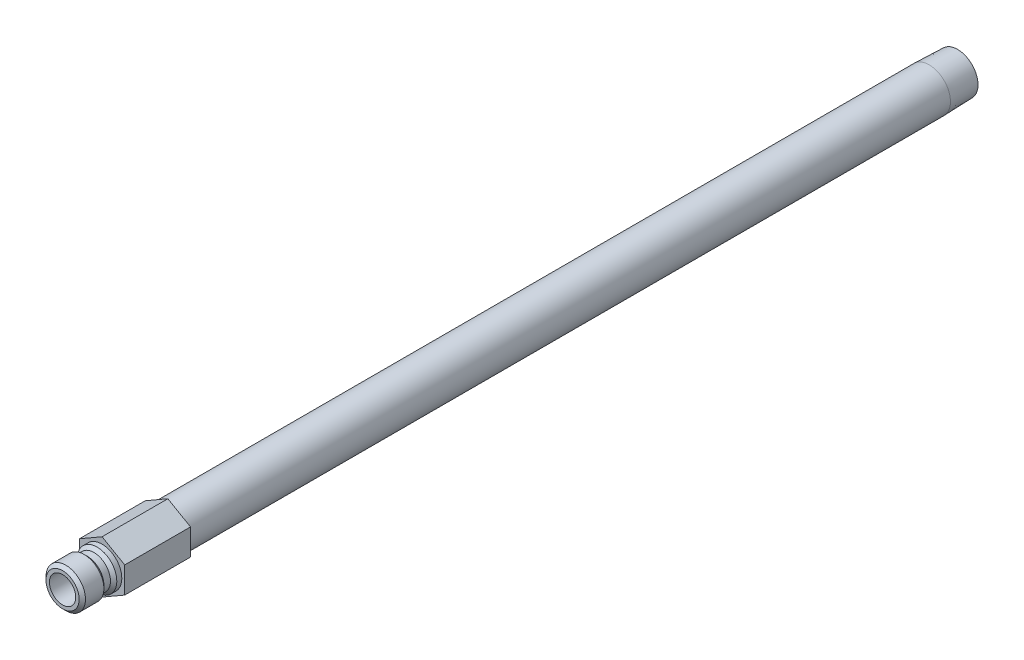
from build123d import *

# Parameters (mm, degrees)
SKETCH2_R           = 2.38125
BOSS_EXTRUDE1_DEPTH = 15.875


with BuildPart() as part:
    # Sketch1 → Revolve1 (revolve)
    with BuildSketch(Plane(origin=(0, 0, 0), x_dir=(0, 0, -1), z_dir=(1, 0, 0))):
        Polygon((-9.525, 3.175), (-9.525, 4.0005), (-8.763, 4.7625), (-4.318, 4.7625), (-3.556, 4.0005), (-1.9685, 4.0005), (-1.2065, 4.7625), (0, 4.7625), (0, 5.1435), (199.517, 5.1435), (206.375, 4.929188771), (206.375, 2.38125), (0.127, 2.38125), (0.127, 3.175), align=None)
    revolve(axis=Axis((0, 0, 0), (0, 0, 1)))

    # Sketch2 → Boss-Extrude1 (add)
    with BuildSketch(Plane.XY):
        Polygon((-5.461, 3.15290982), (-5.461, -3.15290982), (0, -6.30581964), (5.461, -3.15290982), (5.461, 3.15290982), (0, 6.30581964), align=None)
        with Locations(Location((0, 0, 0), (0, 0, 90))):
            Circle(SKETCH2_R, mode=Mode.SUBTRACT)
    extrude(amount=-BOSS_EXTRUDE1_DEPTH)


solid = part.part
